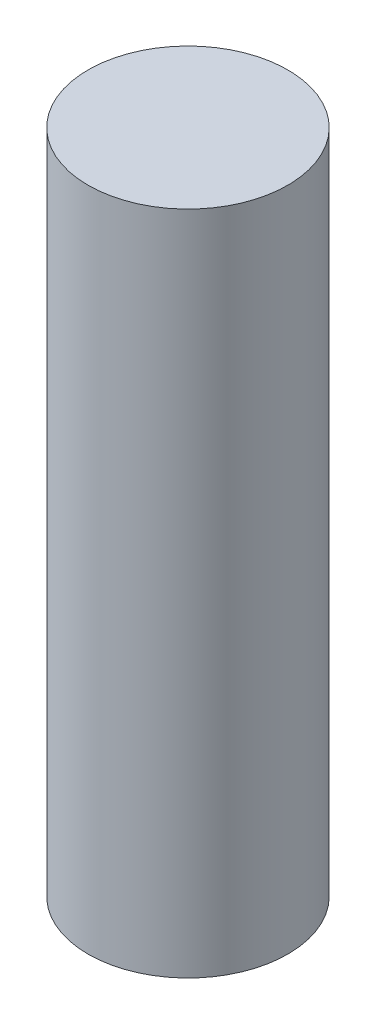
ISO-10303-21;
HEADER;
FILE_DESCRIPTION(('STEP AP214'),'2;1');
FILE_NAME('part.step','',(''),(''),'','','');
FILE_SCHEMA(('AUTOMOTIVE_DESIGN { 1 0 10303 214 1 1 1 1 }'));
ENDSEC;
DATA;
#1=APPLICATION_CONTEXT('core data for automotive mechanical design processes');
#2=APPLICATION_PROTOCOL_DEFINITION('international standard','automotive_design',2000,#1);
#3=PRODUCT_CONTEXT('',#1,'mechanical');
#4=PRODUCT('Part','Part','',(#3));
#5=PRODUCT_RELATED_PRODUCT_CATEGORY('part','',(#4));
#6=PRODUCT_DEFINITION_FORMATION('','',#4);
#7=PRODUCT_DEFINITION_CONTEXT('part definition',#1,'design');
#8=PRODUCT_DEFINITION('design','',#6,#7);
#9=PRODUCT_DEFINITION_SHAPE('','',#8);
#10=(LENGTH_UNIT() NAMED_UNIT(*) SI_UNIT(.MILLI.,.METRE.));
#11=(NAMED_UNIT(*) PLANE_ANGLE_UNIT() SI_UNIT($,.RADIAN.));
#12=(NAMED_UNIT(*) SI_UNIT($,.STERADIAN.) SOLID_ANGLE_UNIT());
#13=UNCERTAINTY_MEASURE_WITH_UNIT(LENGTH_MEASURE(1.E-05),#10,'distance_accuracy_value','');
#14=(GEOMETRIC_REPRESENTATION_CONTEXT(3) GLOBAL_UNCERTAINTY_ASSIGNED_CONTEXT((#13)) GLOBAL_UNIT_ASSIGNED_CONTEXT((#10,
#11,#12)) REPRESENTATION_CONTEXT('',''));
#15=CARTESIAN_POINT('',(0.,0.,0.));
#16=DIRECTION('',(0.,0.,1.));
#17=DIRECTION('',(1.,0.,0.));
#18=AXIS2_PLACEMENT_3D('',#15,#16,#17);
#19=CARTESIAN_POINT('',(0.,-22.5,0.));
#20=DIRECTION('',(0.,1.,0.));
#21=DIRECTION('',(0.,0.,1.));
#22=AXIS2_PLACEMENT_3D('',#19,#20,#21);
#23=PLANE('',#22);
#24=CARTESIAN_POINT('',(0.,-22.5,0.));
#25=DIRECTION('',(0.,1.,0.));
#26=DIRECTION('',(0.,0.,1.));
#27=AXIS2_PLACEMENT_3D('',#24,#25,#26);
#28=CIRCLE('',#27,15.);
#29=CARTESIAN_POINT('',(0.,-22.5,15.));
#30=VERTEX_POINT('',#29);
#31=EDGE_CURVE('E53',#30,#30,#28,.F.);
#32=ORIENTED_EDGE('',*,*,#31,.T.);
#33=EDGE_LOOP('',(#32));
#34=FACE_BOUND('',#33,.T.);
#35=ADVANCED_FACE('F44',(#34),#23,.F.);
#36=CARTESIAN_POINT('',(0.,22.5,0.));
#37=DIRECTION('',(0.,1.,0.));
#38=DIRECTION('',(0.,0.,1.));
#39=AXIS2_PLACEMENT_3D('',#36,#37,#38);
#40=PLANE('',#39);
#41=CARTESIAN_POINT('',(0.,22.5,0.));
#42=DIRECTION('',(0.,1.,0.));
#43=DIRECTION('',(0.,0.,1.));
#44=AXIS2_PLACEMENT_3D('',#41,#42,#43);
#45=CIRCLE('',#44,15.);
#46=CARTESIAN_POINT('',(0.,22.5,15.));
#47=VERTEX_POINT('',#46);
#48=EDGE_CURVE('E11',#47,#47,#45,.T.);
#49=ORIENTED_EDGE('',*,*,#48,.T.);
#50=EDGE_LOOP('',(#49));
#51=FACE_BOUND('',#50,.T.);
#52=ADVANCED_FACE('F83',(#51),#40,.T.);
#53=CARTESIAN_POINT('',(0.,0.,0.));
#54=DIRECTION('',(0.,1.,0.));
#55=DIRECTION('',(0.,0.,-1.));
#56=AXIS2_PLACEMENT_3D('',#53,#54,#55);
#57=CYLINDRICAL_SURFACE('',#56,15.);
#58=ORIENTED_EDGE('',*,*,#31,.F.);
#59=EDGE_LOOP('',(#58));
#60=FACE_BOUND('',#59,.T.);
#61=ORIENTED_EDGE('',*,*,#48,.F.);
#62=EDGE_LOOP('',(#61));
#63=FACE_BOUND('',#62,.T.);
#64=ADVANCED_FACE('F81',(#60,#63),#57,.T.);
#65=CLOSED_SHELL('',(#35,#52,#64));
#66=CARTESIAN_POINT('',(0.,0.5,0.));
#67=DIRECTION('',(0.,-1.,0.));
#68=DIRECTION('',(0.,0.,-1.));
#69=AXIS2_PLACEMENT_3D('',#66,#67,#68);
#70=CYLINDRICAL_SURFACE('',#69,3.);
#71=CARTESIAN_POINT('',(0.,0.5,0.));
#72=DIRECTION('',(0.,1.,0.));
#73=DIRECTION('',(0.,0.,1.));
#74=AXIS2_PLACEMENT_3D('',#71,#72,#73);
#75=CIRCLE('',#74,3.);
#76=CARTESIAN_POINT('',(0.,0.5,3.));
#77=VERTEX_POINT('',#76);
#78=EDGE_CURVE('E48',#77,#77,#75,.T.);
#79=ORIENTED_EDGE('',*,*,#78,.T.);
#80=EDGE_LOOP('',(#79));
#81=FACE_BOUND('',#80,.T.);
#82=CARTESIAN_POINT('',(0.,-0.5,0.));
#83=DIRECTION('',(0.,1.,0.));
#84=DIRECTION('',(0.,0.,1.));
#85=AXIS2_PLACEMENT_3D('',#82,#83,#84);
#86=CIRCLE('',#85,3.);
#87=CARTESIAN_POINT('',(0.,-0.5,3.));
#88=VERTEX_POINT('',#87);
#89=EDGE_CURVE('E58',#88,#88,#86,.T.);
#90=ORIENTED_EDGE('',*,*,#89,.F.);
#91=EDGE_LOOP('',(#90));
#92=FACE_BOUND('',#91,.T.);
#93=ADVANCED_FACE('F66',(#81,#92),#70,.F.);
#94=CARTESIAN_POINT('',(0.,0.5,0.));
#95=DIRECTION('',(0.,1.,0.));
#96=DIRECTION('',(0.,0.,1.));
#97=AXIS2_PLACEMENT_3D('',#94,#95,#96);
#98=PLANE('',#97);
#99=ORIENTED_EDGE('',*,*,#78,.F.);
#100=EDGE_LOOP('',(#99));
#101=FACE_BOUND('',#100,.T.);
#102=ADVANCED_FACE('F46',(#101),#98,.F.);
#103=CARTESIAN_POINT('',(0.,-0.5,0.));
#104=DIRECTION('',(0.,1.,0.));
#105=DIRECTION('',(0.,0.,1.));
#106=AXIS2_PLACEMENT_3D('',#103,#104,#105);
#107=PLANE('',#106);
#108=ORIENTED_EDGE('',*,*,#89,.T.);
#109=EDGE_LOOP('',(#108));
#110=FACE_BOUND('',#109,.T.);
#111=ADVANCED_FACE('F70',(#110),#107,.T.);
#112=CLOSED_SHELL('',(#93,#102,#111));
#113=ORIENTED_CLOSED_SHELL('',*,#112,.T.);
#114=BREP_WITH_VOIDS('B2',#65,(#113));
#115=CARTESIAN_POINT('',(0.,100.,0.));
#116=DIRECTION('',(0.,-1.,0.));
#117=DIRECTION('',(0.,0.,-1.));
#118=AXIS2_PLACEMENT_3D('',#115,#116,#117);
#119=CYLINDRICAL_SURFACE('',#118,30.);
#120=CARTESIAN_POINT('',(0.,100.,0.));
#121=DIRECTION('',(0.,1.,0.));
#122=DIRECTION('',(0.,0.,1.));
#123=AXIS2_PLACEMENT_3D('',#120,#121,#122);
#124=CIRCLE('',#123,30.);
#125=CARTESIAN_POINT('',(0.,100.,30.));
#126=VERTEX_POINT('',#125);
#127=EDGE_CURVE('E42',#126,#126,#124,.T.);
#128=ORIENTED_EDGE('',*,*,#127,.F.);
#129=EDGE_LOOP('',(#128));
#130=FACE_BOUND('',#129,.T.);
#131=CARTESIAN_POINT('',(0.,-100.,0.));
#132=DIRECTION('',(0.,1.,0.));
#133=DIRECTION('',(0.,0.,1.));
#134=AXIS2_PLACEMENT_3D('',#131,#132,#133);
#135=CIRCLE('',#134,30.);
#136=CARTESIAN_POINT('',(0.,-100.,30.));
#137=VERTEX_POINT('',#136);
#138=EDGE_CURVE('E139',#137,#137,#135,.T.);
#139=ORIENTED_EDGE('',*,*,#138,.T.);
#140=EDGE_LOOP('',(#139));
#141=FACE_BOUND('',#140,.T.);
#142=ADVANCED_FACE('F136',(#130,#141),#119,.T.);
#143=CARTESIAN_POINT('',(0.,100.,0.));
#144=DIRECTION('',(0.,1.,0.));
#145=DIRECTION('',(0.,0.,1.));
#146=AXIS2_PLACEMENT_3D('',#143,#144,#145);
#147=PLANE('',#146);
#148=ORIENTED_EDGE('',*,*,#127,.T.);
#149=EDGE_LOOP('',(#148));
#150=FACE_BOUND('',#149,.T.);
#151=ADVANCED_FACE('F172',(#150),#147,.T.);
#152=CARTESIAN_POINT('',(0.,-100.,0.));
#153=DIRECTION('',(0.,1.,0.));
#154=DIRECTION('',(0.,0.,1.));
#155=AXIS2_PLACEMENT_3D('',#152,#153,#154);
#156=PLANE('',#155);
#157=ORIENTED_EDGE('',*,*,#138,.F.);
#158=EDGE_LOOP('',(#157));
#159=FACE_BOUND('',#158,.T.);
#160=ADVANCED_FACE('F174',(#159),#156,.F.);
#161=CLOSED_SHELL('',(#142,#151,#160));
#162=CARTESIAN_POINT('',(0.,25.,0.));
#163=DIRECTION('',(0.,1.,0.));
#164=DIRECTION('',(0.,0.,1.));
#165=AXIS2_PLACEMENT_3D('',#162,#163,#164);
#166=PLANE('',#165);
#167=CARTESIAN_POINT('',(0.,25.,0.));
#168=DIRECTION('',(0.,1.,0.));
#169=DIRECTION('',(0.,0.,-1.));
#170=AXIS2_PLACEMENT_3D('',#167,#168,#169);
#171=CIRCLE('',#170,17.5);
#172=CARTESIAN_POINT('',(0.,25.,-17.5));
#173=VERTEX_POINT('',#172);
#174=EDGE_CURVE('E150',#173,#173,#171,.T.);
#175=ORIENTED_EDGE('',*,*,#174,.F.);
#176=EDGE_LOOP('',(#175));
#177=FACE_BOUND('',#176,.T.);
#178=ADVANCED_FACE('F157',(#177),#166,.F.);
#179=CARTESIAN_POINT('',(0.,0.,0.));
#180=DIRECTION('',(0.,1.,0.));
#181=DIRECTION('',(0.,0.,-1.));
#182=AXIS2_PLACEMENT_3D('',#179,#180,#181);
#183=CYLINDRICAL_SURFACE('',#182,17.5);
#184=ORIENTED_EDGE('',*,*,#174,.T.);
#185=EDGE_LOOP('',(#184));
#186=FACE_BOUND('',#185,.T.);
#187=CARTESIAN_POINT('',(0.,-25.,0.));
#188=DIRECTION('',(0.,1.,0.));
#189=DIRECTION('',(0.,0.,-1.));
#190=AXIS2_PLACEMENT_3D('',#187,#188,#189);
#191=CIRCLE('',#190,17.5);
#192=CARTESIAN_POINT('',(0.,-25.,-17.5));
#193=VERTEX_POINT('',#192);
#194=EDGE_CURVE('E146',#193,#193,#191,.T.);
#195=ORIENTED_EDGE('',*,*,#194,.F.);
#196=EDGE_LOOP('',(#195));
#197=FACE_BOUND('',#196,.T.);
#198=ADVANCED_FACE('F154',(#186,#197),#183,.F.);
#199=CARTESIAN_POINT('',(0.,-25.,0.));
#200=DIRECTION('',(0.,1.,0.));
#201=DIRECTION('',(0.,0.,1.));
#202=AXIS2_PLACEMENT_3D('',#199,#200,#201);
#203=PLANE('',#202);
#204=ORIENTED_EDGE('',*,*,#194,.T.);
#205=EDGE_LOOP('',(#204));
#206=FACE_BOUND('',#205,.T.);
#207=ADVANCED_FACE('F165',(#206),#203,.T.);
#208=CLOSED_SHELL('',(#178,#198,#207));
#209=ORIENTED_CLOSED_SHELL('',*,#208,.T.);
#210=BREP_WITH_VOIDS('B6',#161,(#209));
#211=ADVANCED_BREP_SHAPE_REPRESENTATION('',(#18,#114,#210),#14);
#212=SHAPE_DEFINITION_REPRESENTATION(#9,#211);
ENDSEC;
END-ISO-10303-21;
